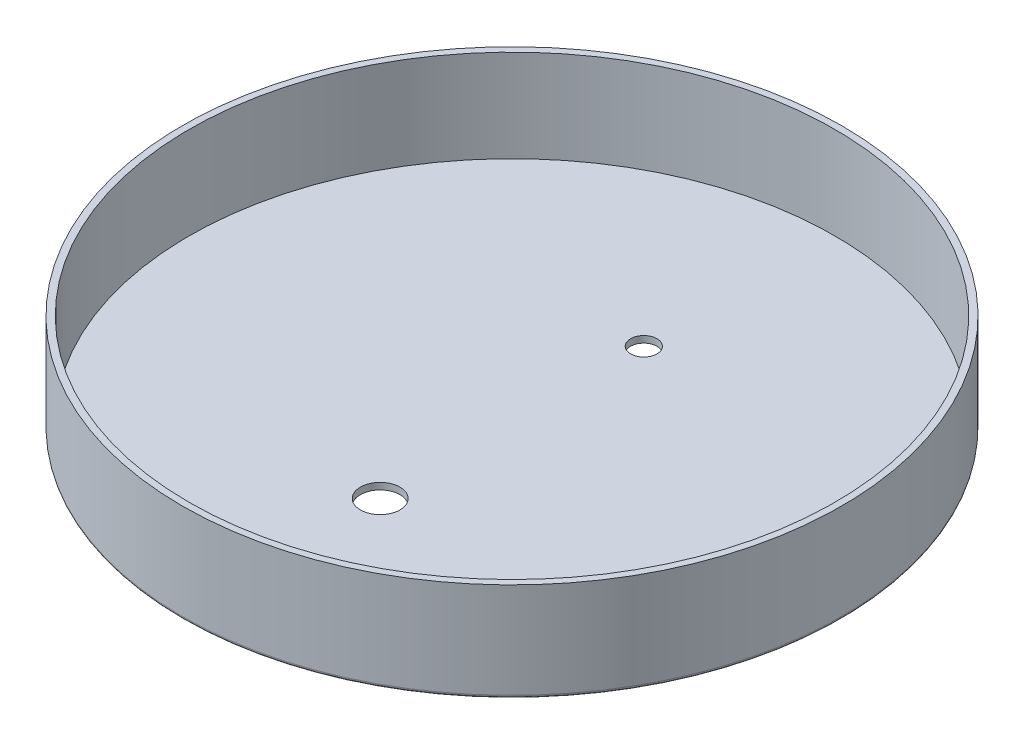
from build123d import *

# Parameters (mm, degrees)
ESQUISSE1_R             = 50
EXTRUSION1_DEPTH        = 15
COQUE1_T                = -1
CONG_1_R                = 0.5
ESQUISSE2_R             = 2
ESQUISSE2_R_2           = 3
ENL_V_MAT_EXTRU_1_DEPTH = 10


with BuildPart() as part:
    # Esquisse1 → Extrusion1 (new body)
    with BuildSketch(Plane(origin=(0, 0, 0), x_dir=(1, 0, 0), z_dir=(0, 1, 0))):
        with Locations(Location((0, 0, 0), (0, 0, 270))):
            Circle(ESQUISSE1_R)
    extrude(amount=EXTRUSION1_DEPTH)

    # Coque1
    coque1_openings = [part.faces().sort_by_distance(p)[0] for p in [
        (0, 15, 0),
    ]]
    offset(amount=COQUE1_T, openings=coque1_openings, kind=Kind.INTERSECTION)

    # Cong_1
    cong_1_edges = [part.edges().sort_by_distance(p)[0] for p in [
        (0, 0, -50),
    ]]
    fillet(cong_1_edges, radius=CONG_1_R)

    # Esquisse2 → Enl_v. mat.-Extru.1 (cut)
    with BuildSketch(Plane.XZ):
        with Locations(Location((0, -20, 0), (0, 0, 270))):
            Circle(ESQUISSE2_R)
        with Locations(Location((0, 20, 0), (0, 0, 270))):
            Circle(ESQUISSE2_R_2)
    extrude(amount=-ENL_V_MAT_EXTRU_1_DEPTH, mode=Mode.SUBTRACT)


solid = part.part
